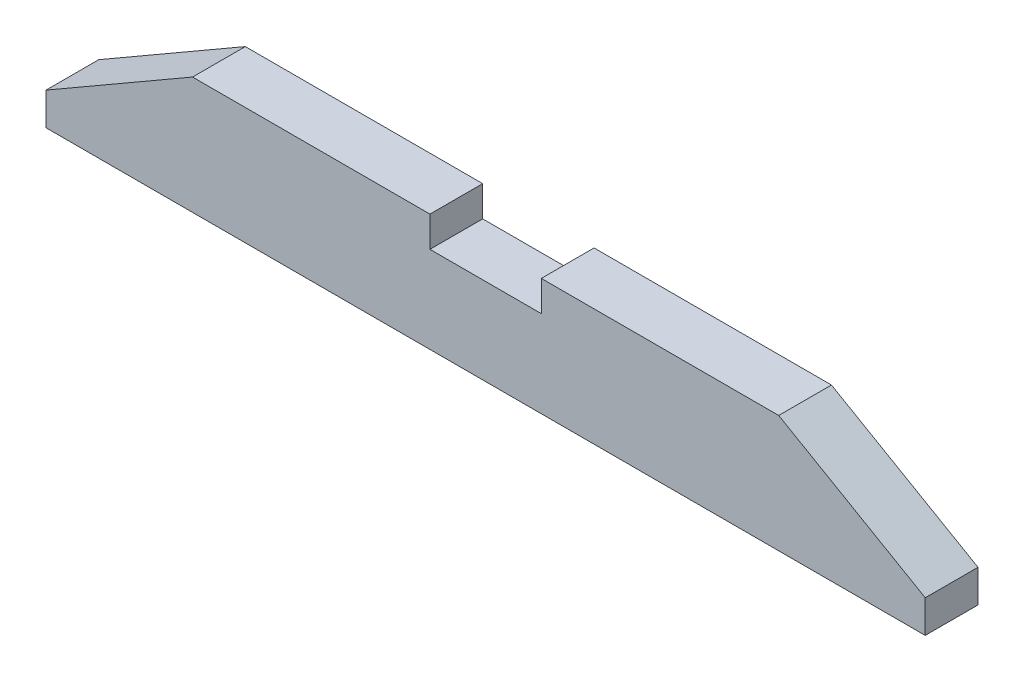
from build123d import *

# Parameters (mm, degrees)
BOSS_EXTRU_1_DEPTH = 18
CHANFREIN1_SIZE    = 50
CHANFREIN1_SIZE2   = 28.867513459
CHANFREIN2_SIZE    = 50
CHANFREIN2_SIZE2   = 28.867513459


with BuildPart() as part:
    # Esquisse1 → Boss.-Extru.1 (new body)
    with BuildSketch(Plane.XY):
        Polygon((-19, -581.211593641), (-150, -581.211593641), (-150, -621.211593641), (150, -621.211593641), (150, -581.211593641), (19, -581.211593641), (19, -591.624690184), (-19, -591.624690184), align=None)
    extrude(amount=BOSS_EXTRU_1_DEPTH)

    # Chanfrein1
    chanfrein1_edges = [part.edges().sort_by_distance(p)[0] for p in [
        (-150, -581.211593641, 9),
    ]]
    chanfrein1_side = [part.faces().sort_by_distance(p)[0] for p in [
        (-84.5, -581.211593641, 9),
    ]]
    chamfer(chanfrein1_edges, length=CHANFREIN1_SIZE, length2=CHANFREIN1_SIZE2, reference=chanfrein1_side[0])

    # Chanfrein2
    chanfrein2_edges = [part.edges().sort_by_distance(p)[0] for p in [
        (150, -581.211593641, 9),
    ]]
    chanfrein2_side = [part.faces().sort_by_distance(p)[0] for p in [
        (84.5, -581.211593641, 9),
    ]]
    chamfer(chanfrein2_edges, length=CHANFREIN2_SIZE, length2=CHANFREIN2_SIZE2, reference=chanfrein2_side[0])


solid = part.part
